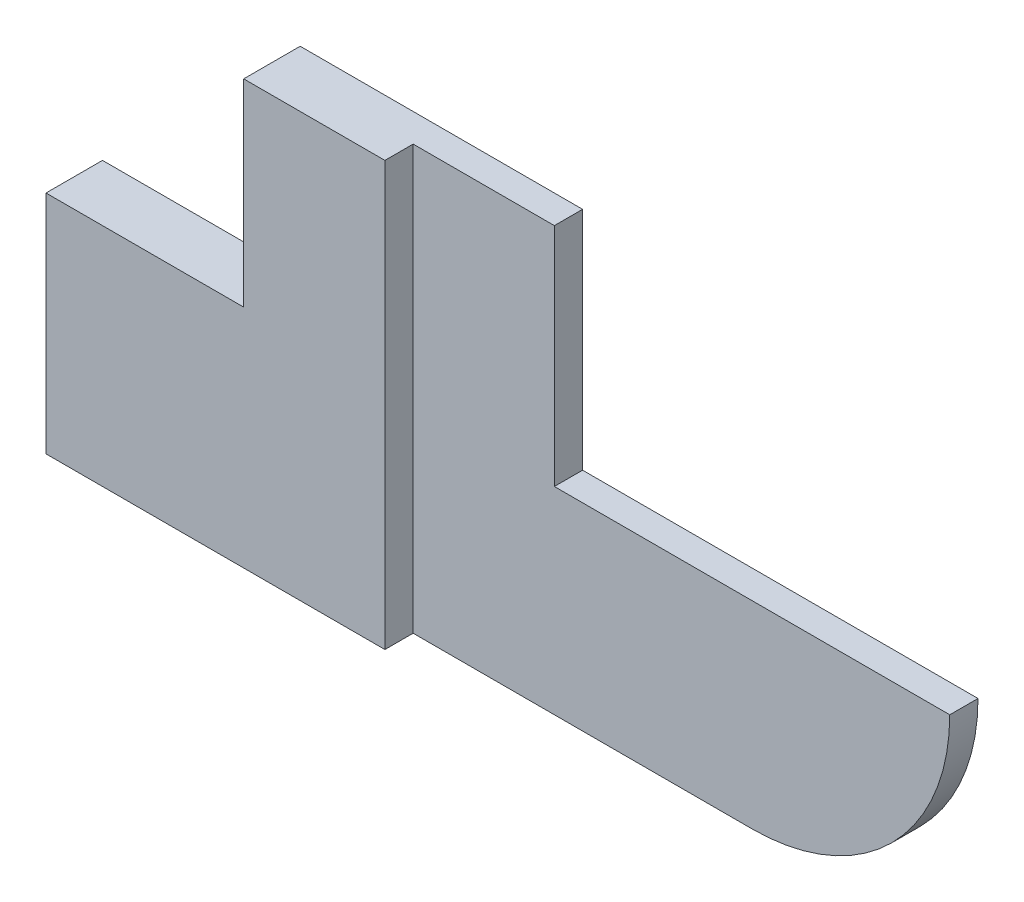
ISO-10303-21;
HEADER;
FILE_DESCRIPTION(('STEP AP214'),'2;1');
FILE_NAME('part.step','',(''),(''),'','','');
FILE_SCHEMA(('AUTOMOTIVE_DESIGN { 1 0 10303 214 1 1 1 1 }'));
ENDSEC;
DATA;
#1=APPLICATION_CONTEXT('core data for automotive mechanical design processes');
#2=APPLICATION_PROTOCOL_DEFINITION('international standard','automotive_design',2000,#1);
#3=PRODUCT_CONTEXT('',#1,'mechanical');
#4=PRODUCT('Part','Part','',(#3));
#5=PRODUCT_RELATED_PRODUCT_CATEGORY('part','',(#4));
#6=PRODUCT_DEFINITION_FORMATION('','',#4);
#7=PRODUCT_DEFINITION_CONTEXT('part definition',#1,'design');
#8=PRODUCT_DEFINITION('design','',#6,#7);
#9=PRODUCT_DEFINITION_SHAPE('','',#8);
#10=(LENGTH_UNIT() NAMED_UNIT(*) SI_UNIT(.MILLI.,.METRE.));
#11=(NAMED_UNIT(*) PLANE_ANGLE_UNIT() SI_UNIT($,.RADIAN.));
#12=(NAMED_UNIT(*) SI_UNIT($,.STERADIAN.) SOLID_ANGLE_UNIT());
#13=UNCERTAINTY_MEASURE_WITH_UNIT(LENGTH_MEASURE(1.E-05),#10,'distance_accuracy_value','');
#14=(GEOMETRIC_REPRESENTATION_CONTEXT(3) GLOBAL_UNCERTAINTY_ASSIGNED_CONTEXT((#13)) GLOBAL_UNIT_ASSIGNED_CONTEXT((#10,
#11,#12)) REPRESENTATION_CONTEXT('',''));
#15=CARTESIAN_POINT('',(0.,0.,0.));
#16=DIRECTION('',(0.,0.,1.));
#17=DIRECTION('',(1.,0.,0.));
#18=AXIS2_PLACEMENT_3D('',#15,#16,#17);
#19=CARTESIAN_POINT('',(120.,35.,10.));
#20=DIRECTION('',(0.,0.,-1.));
#21=DIRECTION('',(-1.,0.,0.));
#22=AXIS2_PLACEMENT_3D('',#19,#20,#21);
#23=CYLINDRICAL_SURFACE('',#22,35.);
#24=CARTESIAN_POINT('',(120.,35.,5.));
#25=DIRECTION('',(0.,0.,1.));
#26=DIRECTION('',(1.,0.,0.));
#27=AXIS2_PLACEMENT_3D('',#24,#25,#26);
#28=CIRCLE('',#27,35.);
#29=CARTESIAN_POINT('',(120.,0.,5.));
#30=VERTEX_POINT('',#29);
#31=CARTESIAN_POINT('',(155.,35.,5.));
#32=VERTEX_POINT('',#31);
#33=EDGE_CURVE('E194',#30,#32,#28,.T.);
#34=ORIENTED_EDGE('',*,*,#33,.F.);
#35=DIRECTION('',(0.,0.,-1.));
#36=VECTOR('',#35,1.);
#37=CARTESIAN_POINT('',(120.,0.,10.));
#38=LINE('',#37,#36);
#39=CARTESIAN_POINT('',(120.,0.,0.));
#40=VERTEX_POINT('',#39);
#41=EDGE_CURVE('E11',#30,#40,#38,.T.);
#42=ORIENTED_EDGE('',*,*,#41,.T.);
#43=CARTESIAN_POINT('',(120.,35.,0.));
#44=DIRECTION('',(0.,0.,1.));
#45=DIRECTION('',(-1.,0.,0.));
#46=AXIS2_PLACEMENT_3D('',#43,#44,#45);
#47=CIRCLE('',#46,35.);
#48=CARTESIAN_POINT('',(155.,35.,0.));
#49=VERTEX_POINT('',#48);
#50=EDGE_CURVE('E167',#40,#49,#47,.T.);
#51=ORIENTED_EDGE('',*,*,#50,.T.);
#52=DIRECTION('',(0.,0.,-1.));
#53=VECTOR('',#52,1.);
#54=CARTESIAN_POINT('',(155.,35.,10.));
#55=LINE('',#54,#53);
#56=EDGE_CURVE('E41',#32,#49,#55,.T.);
#57=ORIENTED_EDGE('',*,*,#56,.F.);
#58=EDGE_LOOP('',(#34,#42,#51,#57));
#59=FACE_BOUND('',#58,.T.);
#60=ADVANCED_FACE('F33',(#59),#23,.T.);
#61=CARTESIAN_POINT('',(85.,35.,10.));
#62=DIRECTION('',(0.,-1.,0.));
#63=DIRECTION('',(0.,0.,-1.));
#64=AXIS2_PLACEMENT_3D('',#61,#62,#63);
#65=PLANE('',#64);
#66=DIRECTION('',(-1.,0.,0.));
#67=VECTOR('',#66,1.);
#68=CARTESIAN_POINT('',(85.,35.,5.));
#69=LINE('',#68,#67);
#70=CARTESIAN_POINT('',(85.,35.,5.));
#71=VERTEX_POINT('',#70);
#72=EDGE_CURVE('E163',#32,#71,#69,.T.);
#73=ORIENTED_EDGE('',*,*,#72,.F.);
#74=ORIENTED_EDGE('',*,*,#56,.T.);
#75=DIRECTION('',(-1.,0.,0.));
#76=VECTOR('',#75,1.);
#77=CARTESIAN_POINT('',(85.,35.,0.));
#78=LINE('',#77,#76);
#79=CARTESIAN_POINT('',(85.,35.,0.));
#80=VERTEX_POINT('',#79);
#81=EDGE_CURVE('E161',#49,#80,#78,.T.);
#82=ORIENTED_EDGE('',*,*,#81,.T.);
#83=DIRECTION('',(0.,0.,-1.));
#84=VECTOR('',#83,1.);
#85=CARTESIAN_POINT('',(85.,35.,10.));
#86=LINE('',#85,#84);
#87=EDGE_CURVE('E152',#71,#80,#86,.T.);
#88=ORIENTED_EDGE('',*,*,#87,.F.);
#89=EDGE_LOOP('',(#73,#74,#82,#88));
#90=FACE_BOUND('',#89,.T.);
#91=ADVANCED_FACE('F158',(#90),#65,.F.);
#92=CARTESIAN_POINT('',(85.,75.,10.));
#93=DIRECTION('',(-1.,0.,0.));
#94=DIRECTION('',(0.,0.,1.));
#95=AXIS2_PLACEMENT_3D('',#92,#93,#94);
#96=PLANE('',#95);
#97=DIRECTION('',(0.,1.,0.));
#98=VECTOR('',#97,1.);
#99=CARTESIAN_POINT('',(85.,75.,5.));
#100=LINE('',#99,#98);
#101=CARTESIAN_POINT('',(85.,75.,5.));
#102=VERTEX_POINT('',#101);
#103=EDGE_CURVE('E198',#71,#102,#100,.T.);
#104=ORIENTED_EDGE('',*,*,#103,.F.);
#105=ORIENTED_EDGE('',*,*,#87,.T.);
#106=DIRECTION('',(0.,1.,0.));
#107=VECTOR('',#106,1.);
#108=CARTESIAN_POINT('',(85.,75.,0.));
#109=LINE('',#108,#107);
#110=CARTESIAN_POINT('',(85.,75.,0.));
#111=VERTEX_POINT('',#110);
#112=EDGE_CURVE('E176',#80,#111,#109,.T.);
#113=ORIENTED_EDGE('',*,*,#112,.T.);
#114=DIRECTION('',(0.,0.,-1.));
#115=VECTOR('',#114,1.);
#116=CARTESIAN_POINT('',(85.,75.,10.));
#117=LINE('',#116,#115);
#118=EDGE_CURVE('E150',#102,#111,#117,.T.);
#119=ORIENTED_EDGE('',*,*,#118,.F.);
#120=EDGE_LOOP('',(#104,#105,#113,#119));
#121=FACE_BOUND('',#120,.T.);
#122=ADVANCED_FACE('F215',(#121),#96,.F.);
#123=CARTESIAN_POINT('',(120.,0.,10.));
#124=DIRECTION('',(0.,1.,0.));
#125=DIRECTION('',(-1.,0.,0.));
#126=AXIS2_PLACEMENT_3D('',#123,#124,#125);
#127=PLANE('',#126);
#128=DIRECTION('',(1.,0.,0.));
#129=VECTOR('',#128,1.);
#130=CARTESIAN_POINT('',(60.,0.,5.));
#131=LINE('',#130,#129);
#132=CARTESIAN_POINT('',(60.,0.,5.));
#133=VERTEX_POINT('',#132);
#134=EDGE_CURVE('E122',#133,#30,#131,.T.);
#135=ORIENTED_EDGE('',*,*,#134,.F.);
#136=DIRECTION('',(0.,0.,1.));
#137=VECTOR('',#136,1.);
#138=CARTESIAN_POINT('',(60.,0.,5.));
#139=LINE('',#138,#137);
#140=CARTESIAN_POINT('',(60.,0.,10.));
#141=VERTEX_POINT('',#140);
#142=EDGE_CURVE('E111',#133,#141,#139,.T.);
#143=ORIENTED_EDGE('',*,*,#142,.T.);
#144=DIRECTION('',(1.,0.,0.));
#145=VECTOR('',#144,1.);
#146=CARTESIAN_POINT('',(120.,0.,10.));
#147=LINE('',#146,#145);
#148=CARTESIAN_POINT('',(0.,0.,10.));
#149=VERTEX_POINT('',#148);
#150=EDGE_CURVE('E120',#149,#141,#147,.T.);
#151=ORIENTED_EDGE('',*,*,#150,.F.);
#152=DIRECTION('',(0.,0.,-1.));
#153=VECTOR('',#152,1.);
#154=CARTESIAN_POINT('',(0.,0.,10.));
#155=LINE('',#154,#153);
#156=CARTESIAN_POINT('',(0.,0.,0.));
#157=VERTEX_POINT('',#156);
#158=EDGE_CURVE('E139',#149,#157,#155,.T.);
#159=ORIENTED_EDGE('',*,*,#158,.T.);
#160=DIRECTION('',(1.,0.,0.));
#161=VECTOR('',#160,1.);
#162=CARTESIAN_POINT('',(120.,0.,0.));
#163=LINE('',#162,#161);
#164=EDGE_CURVE('E171',#157,#40,#163,.T.);
#165=ORIENTED_EDGE('',*,*,#164,.T.);
#166=ORIENTED_EDGE('',*,*,#41,.F.);
#167=EDGE_LOOP('',(#135,#143,#151,#159,#165,#166));
#168=FACE_BOUND('',#167,.T.);
#169=ADVANCED_FACE('F35',(#168),#127,.F.);
#170=CARTESIAN_POINT('',(35.,75.,10.));
#171=DIRECTION('',(0.,-1.,0.));
#172=DIRECTION('',(0.,0.,-1.));
#173=AXIS2_PLACEMENT_3D('',#170,#171,#172);
#174=PLANE('',#173);
#175=DIRECTION('',(-1.,0.,0.));
#176=VECTOR('',#175,1.);
#177=CARTESIAN_POINT('',(35.,75.,10.));
#178=LINE('',#177,#176);
#179=CARTESIAN_POINT('',(60.,75.,10.));
#180=VERTEX_POINT('',#179);
#181=CARTESIAN_POINT('',(35.,75.,10.));
#182=VERTEX_POINT('',#181);
#183=EDGE_CURVE('E126',#180,#182,#178,.T.);
#184=ORIENTED_EDGE('',*,*,#183,.F.);
#185=DIRECTION('',(0.,0.,1.));
#186=VECTOR('',#185,1.);
#187=CARTESIAN_POINT('',(60.,75.,5.));
#188=LINE('',#187,#186);
#189=CARTESIAN_POINT('',(60.,75.,5.));
#190=VERTEX_POINT('',#189);
#191=EDGE_CURVE('E48',#190,#180,#188,.T.);
#192=ORIENTED_EDGE('',*,*,#191,.F.);
#193=DIRECTION('',(-1.,0.,0.));
#194=VECTOR('',#193,1.);
#195=CARTESIAN_POINT('',(60.,75.,5.));
#196=LINE('',#195,#194);
#197=EDGE_CURVE('E123',#102,#190,#196,.T.);
#198=ORIENTED_EDGE('',*,*,#197,.F.);
#199=ORIENTED_EDGE('',*,*,#118,.T.);
#200=DIRECTION('',(-1.,0.,0.));
#201=VECTOR('',#200,1.);
#202=CARTESIAN_POINT('',(35.,75.,0.));
#203=LINE('',#202,#201);
#204=CARTESIAN_POINT('',(35.,75.,0.));
#205=VERTEX_POINT('',#204);
#206=EDGE_CURVE('E178',#111,#205,#203,.T.);
#207=ORIENTED_EDGE('',*,*,#206,.T.);
#208=DIRECTION('',(0.,0.,-1.));
#209=VECTOR('',#208,1.);
#210=CARTESIAN_POINT('',(35.,75.,10.));
#211=LINE('',#210,#209);
#212=EDGE_CURVE('E147',#182,#205,#211,.T.);
#213=ORIENTED_EDGE('',*,*,#212,.F.);
#214=EDGE_LOOP('',(#184,#192,#198,#199,#207,#213));
#215=FACE_BOUND('',#214,.T.);
#216=ADVANCED_FACE('F207',(#215),#174,.F.);
#217=CARTESIAN_POINT('',(35.,40.,10.));
#218=DIRECTION('',(1.,0.,0.));
#219=DIRECTION('',(0.,0.,-1.));
#220=AXIS2_PLACEMENT_3D('',#217,#218,#219);
#221=PLANE('',#220);
#222=DIRECTION('',(0.,-1.,0.));
#223=VECTOR('',#222,1.);
#224=CARTESIAN_POINT('',(35.,40.,0.));
#225=LINE('',#224,#223);
#226=CARTESIAN_POINT('',(35.,40.,0.));
#227=VERTEX_POINT('',#226);
#228=EDGE_CURVE('E183',#205,#227,#225,.T.);
#229=ORIENTED_EDGE('',*,*,#228,.T.);
#230=DIRECTION('',(0.,0.,-1.));
#231=VECTOR('',#230,1.);
#232=CARTESIAN_POINT('',(35.,40.,10.));
#233=LINE('',#232,#231);
#234=CARTESIAN_POINT('',(35.,40.,10.));
#235=VERTEX_POINT('',#234);
#236=EDGE_CURVE('E144',#235,#227,#233,.T.);
#237=ORIENTED_EDGE('',*,*,#236,.F.);
#238=DIRECTION('',(0.,-1.,0.));
#239=VECTOR('',#238,1.);
#240=CARTESIAN_POINT('',(35.,40.,10.));
#241=LINE('',#240,#239);
#242=EDGE_CURVE('E129',#182,#235,#241,.T.);
#243=ORIENTED_EDGE('',*,*,#242,.F.);
#244=ORIENTED_EDGE('',*,*,#212,.T.);
#245=EDGE_LOOP('',(#229,#237,#243,#244));
#246=FACE_BOUND('',#245,.T.);
#247=ADVANCED_FACE('F212',(#246),#221,.F.);
#248=CARTESIAN_POINT('',(0.,40.,10.));
#249=DIRECTION('',(0.,-1.,0.));
#250=DIRECTION('',(0.,0.,-1.));
#251=AXIS2_PLACEMENT_3D('',#248,#249,#250);
#252=PLANE('',#251);
#253=DIRECTION('',(-1.,0.,0.));
#254=VECTOR('',#253,1.);
#255=CARTESIAN_POINT('',(0.,40.,0.));
#256=LINE('',#255,#254);
#257=CARTESIAN_POINT('',(0.,40.,0.));
#258=VERTEX_POINT('',#257);
#259=EDGE_CURVE('E131',#227,#258,#256,.T.);
#260=ORIENTED_EDGE('',*,*,#259,.T.);
#261=DIRECTION('',(0.,0.,-1.));
#262=VECTOR('',#261,1.);
#263=CARTESIAN_POINT('',(0.,40.,10.));
#264=LINE('',#263,#262);
#265=CARTESIAN_POINT('',(0.,40.,10.));
#266=VERTEX_POINT('',#265);
#267=EDGE_CURVE('E141',#266,#258,#264,.T.);
#268=ORIENTED_EDGE('',*,*,#267,.F.);
#269=DIRECTION('',(-1.,0.,0.));
#270=VECTOR('',#269,1.);
#271=CARTESIAN_POINT('',(0.,40.,10.));
#272=LINE('',#271,#270);
#273=EDGE_CURVE('E136',#235,#266,#272,.T.);
#274=ORIENTED_EDGE('',*,*,#273,.F.);
#275=ORIENTED_EDGE('',*,*,#236,.T.);
#276=EDGE_LOOP('',(#260,#268,#274,#275));
#277=FACE_BOUND('',#276,.T.);
#278=ADVANCED_FACE('F187',(#277),#252,.F.);
#279=CARTESIAN_POINT('',(0.,0.,10.));
#280=DIRECTION('',(1.,0.,0.));
#281=DIRECTION('',(0.,0.,-1.));
#282=AXIS2_PLACEMENT_3D('',#279,#280,#281);
#283=PLANE('',#282);
#284=DIRECTION('',(0.,-1.,0.));
#285=VECTOR('',#284,1.);
#286=CARTESIAN_POINT('',(0.,0.,0.));
#287=LINE('',#286,#285);
#288=EDGE_CURVE('E127',#258,#157,#287,.T.);
#289=ORIENTED_EDGE('',*,*,#288,.T.);
#290=ORIENTED_EDGE('',*,*,#158,.F.);
#291=DIRECTION('',(0.,-1.,0.));
#292=VECTOR('',#291,1.);
#293=CARTESIAN_POINT('',(0.,0.,10.));
#294=LINE('',#293,#292);
#295=EDGE_CURVE('E56',#266,#149,#294,.T.);
#296=ORIENTED_EDGE('',*,*,#295,.F.);
#297=ORIENTED_EDGE('',*,*,#267,.T.);
#298=EDGE_LOOP('',(#289,#290,#296,#297));
#299=FACE_BOUND('',#298,.T.);
#300=ADVANCED_FACE('F193',(#299),#283,.F.);
#301=CARTESIAN_POINT('',(120.,35.,10.));
#302=DIRECTION('',(0.,0.,-1.));
#303=DIRECTION('',(-1.,0.,0.));
#304=AXIS2_PLACEMENT_3D('',#301,#302,#303);
#305=PLANE('',#304);
#306=ORIENTED_EDGE('',*,*,#150,.T.);
#307=DIRECTION('',(0.,-1.,0.));
#308=VECTOR('',#307,1.);
#309=CARTESIAN_POINT('',(60.,75.,10.));
#310=LINE('',#309,#308);
#311=EDGE_CURVE('E108',#180,#141,#310,.T.);
#312=ORIENTED_EDGE('',*,*,#311,.F.);
#313=ORIENTED_EDGE('',*,*,#183,.T.);
#314=ORIENTED_EDGE('',*,*,#242,.T.);
#315=ORIENTED_EDGE('',*,*,#273,.T.);
#316=ORIENTED_EDGE('',*,*,#295,.T.);
#317=EDGE_LOOP('',(#306,#312,#313,#314,#315,#316));
#318=FACE_BOUND('',#317,.T.);
#319=ADVANCED_FACE('F125',(#318),#305,.F.);
#320=CARTESIAN_POINT('',(120.,35.,0.));
#321=DIRECTION('',(0.,0.,-1.));
#322=DIRECTION('',(-1.,0.,0.));
#323=AXIS2_PLACEMENT_3D('',#320,#321,#322);
#324=PLANE('',#323);
#325=ORIENTED_EDGE('',*,*,#164,.F.);
#326=ORIENTED_EDGE('',*,*,#288,.F.);
#327=ORIENTED_EDGE('',*,*,#259,.F.);
#328=ORIENTED_EDGE('',*,*,#228,.F.);
#329=ORIENTED_EDGE('',*,*,#206,.F.);
#330=ORIENTED_EDGE('',*,*,#112,.F.);
#331=ORIENTED_EDGE('',*,*,#81,.F.);
#332=ORIENTED_EDGE('',*,*,#50,.F.);
#333=EDGE_LOOP('',(#325,#326,#327,#328,#329,#330,#331,#332));
#334=FACE_BOUND('',#333,.T.);
#335=ADVANCED_FACE('F173',(#334),#324,.T.);
#336=CARTESIAN_POINT('',(60.,0.,5.));
#337=DIRECTION('',(0.,0.,1.));
#338=DIRECTION('',(1.,0.,0.));
#339=AXIS2_PLACEMENT_3D('',#336,#337,#338);
#340=PLANE('',#339);
#341=ORIENTED_EDGE('',*,*,#33,.T.);
#342=ORIENTED_EDGE('',*,*,#72,.T.);
#343=ORIENTED_EDGE('',*,*,#103,.T.);
#344=ORIENTED_EDGE('',*,*,#197,.T.);
#345=DIRECTION('',(0.,-1.,0.));
#346=VECTOR('',#345,1.);
#347=CARTESIAN_POINT('',(60.,75.,5.));
#348=LINE('',#347,#346);
#349=EDGE_CURVE('E114',#190,#133,#348,.T.);
#350=ORIENTED_EDGE('',*,*,#349,.T.);
#351=ORIENTED_EDGE('',*,*,#134,.T.);
#352=EDGE_LOOP('',(#341,#342,#343,#344,#350,#351));
#353=FACE_BOUND('',#352,.T.);
#354=ADVANCED_FACE('F204',(#353),#340,.T.);
#355=CARTESIAN_POINT('',(60.,75.,5.));
#356=DIRECTION('',(-1.,0.,0.));
#357=DIRECTION('',(0.,-1.,0.));
#358=AXIS2_PLACEMENT_3D('',#355,#356,#357);
#359=PLANE('',#358);
#360=ORIENTED_EDGE('',*,*,#311,.T.);
#361=ORIENTED_EDGE('',*,*,#142,.F.);
#362=ORIENTED_EDGE('',*,*,#349,.F.);
#363=ORIENTED_EDGE('',*,*,#191,.T.);
#364=EDGE_LOOP('',(#360,#361,#362,#363));
#365=FACE_BOUND('',#364,.T.);
#366=ADVANCED_FACE('F110',(#365),#359,.F.);
#367=CLOSED_SHELL('',(#60,#91,#122,#169,#216,#247,#278,#300,#319,#335,#354,#366));
#368=MANIFOLD_SOLID_BREP('B2',#367);
#369=ADVANCED_BREP_SHAPE_REPRESENTATION('',(#18,#368),#14);
#370=SHAPE_DEFINITION_REPRESENTATION(#9,#369);
ENDSEC;
END-ISO-10303-21;
